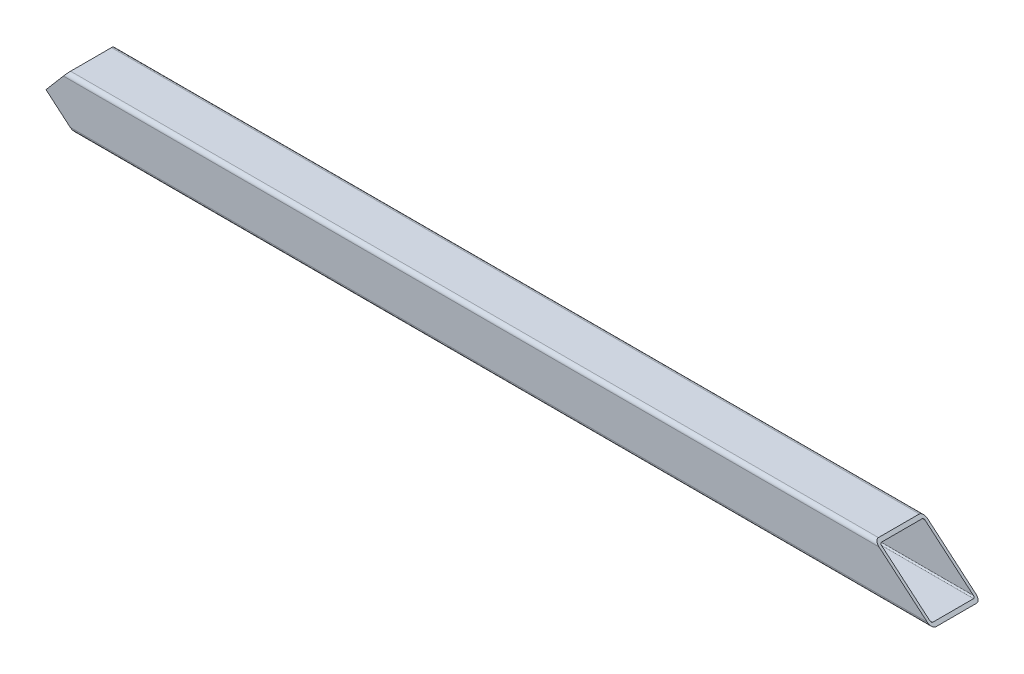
from build123d import *

# Parameters (mm, degrees)
BOSS_EXTRUDE1_DEPTH = 698.5
CUT_EXTRUDE4_DEPTH  = 38.1


with BuildPart() as part:
    # Sketch1 → Boss-Extrude1 (new body)
    with BuildSketch(Plane(origin=(0, 0, 0), x_dir=(0, 0, -1), z_dir=(1, 0, 0))):
        with BuildLine():
            Line((0, 2.54), (0, 29.21))
            ThreePointArc((0, 29.21), (-0.743948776, 31.006051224), (-2.54, 31.75))
            Line((-2.54, 31.75), (-29.21, 31.75))
            ThreePointArc((-29.21, 31.75), (-31.006051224, 31.006051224), (-31.75, 29.21))
            Line((-31.75, 29.21), (-31.75, 2.54))
            ThreePointArc((-31.75, 2.54), (-31.006051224, 0.743948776), (-29.21, 0))
            Line((-29.21, 0), (-2.54, 0))
            ThreePointArc((-2.54, 0), (-0.743948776, 0.743948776), (0, 2.54))
        make_face()
        with BuildLine():
            Line((-1.651, 2.54), (-1.651, 29.21))
            ThreePointArc((-1.651, 29.21), (-1.911382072, 29.838617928), (-2.54, 30.099))
            Line((-2.54, 30.099), (-29.21, 30.099))
            ThreePointArc((-29.21, 30.099), (-29.838617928, 29.838617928), (-30.099, 29.21))
            Line((-30.099, 29.21), (-30.099, 2.54))
            ThreePointArc((-30.099, 2.54), (-29.838617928, 1.911382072), (-29.21, 1.651))
            Line((-29.21, 1.651), (-2.54, 1.651))
            ThreePointArc((-2.54, 1.651), (-1.911382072, 1.911382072), (-1.651, 2.54))
        make_face(mode=Mode.SUBTRACT)
    extrude(amount=BOSS_EXTRUDE1_DEPTH)

    # Sketch5 → Cut-Extrude4 (cut)
    with BuildSketch(Plane.XY.offset(31.75)):
        Polygon((583.843029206, -5.256037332), (527.342768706, 42.753386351), (627.880631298, 161.072145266), (762.27107499, 46.877844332), (661.733212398, -71.440914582), align=None)
        Polygon((20.623884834, -1.649535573), (0, 15.875), (15.484157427, 34.097650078), (6.592515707, 41.653059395), (-8.89164172, 23.430409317), (-10.279454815, 3.777544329), (10.344430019, -13.746991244), align=None)
    extrude(amount=-CUT_EXTRUDE4_DEPTH, mode=Mode.SUBTRACT)


solid = part.part
